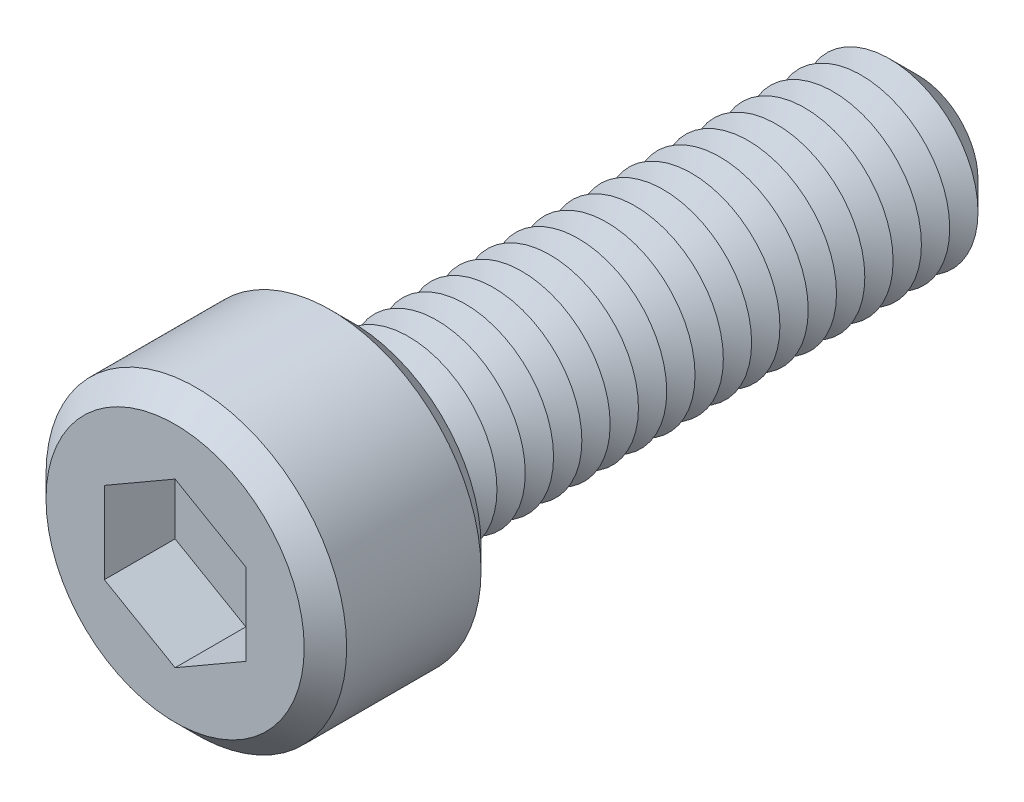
from build123d import *

# Parameters (mm, degrees)
SKETCH1_R           = 4.25
BOSS_EXTRUDE1_DEPTH = 5
SKETCH2_R           = 2.5
BOSS_EXTRUDE2_DEPTH = 16
CHAMFER1_SIZE       = 0.8
LPATTERN1_COUNT     = 19
LPATTERN1_PITCH     = 0.8
CUT_EXTRUDE1_DEPTH  = 2
SKETCH6_R           = 0.65
CUT_EXTRUDE2_DEPTH  = 19
CHAMFER2_SIZE       = 0.6


with BuildPart() as part:
    # Sketch1 → Boss-Extrude1 (new body)
    with BuildSketch(Plane.XY):
        Circle(SKETCH1_R)
    extrude(amount=BOSS_EXTRUDE1_DEPTH)

    # Sketch2 → Boss-Extrude2 (add)
    with BuildSketch(Plane(origin=(0, 0, 0), x_dir=(-1, 0, 0), z_dir=(0, 0, -1))):
        Circle(SKETCH2_R)
    extrude(amount=BOSS_EXTRUDE2_DEPTH)

    # Chamfer1
    chamfer1_edges = [part.edges().sort_by_distance(p)[0] for p in [
        (2.5, 0, -16),
    ]]
    chamfer(chamfer1_edges, length=CHAMFER1_SIZE)

    # Sketch4 → Cut-Revolve1 (revolve, cut)
    with BuildSketch(Plane(origin=(0, 0, 0), x_dir=(0, 0, -1), z_dir=(1, 0, 0)), mode=Mode.PRIVATE) as cut_revolve1_sk:
        Polygon((0, 2.5), (0.4, 1.807179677), (0.8, 2.5), align=None)
    cut_revolve1 = revolve(cut_revolve1_sk.sketch.rotate(Axis((0, 0, 2.512122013), (0, 0, -1)), 90), axis=Axis((0, 0, 2.512122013), (0, 0, -1)), mode=Mode.SUBTRACT)

    # LPattern1: Cut-Revolve1 ×19
    with Locations(*[(0, 0, -i * LPATTERN1_PITCH) for i in range(1, LPATTERN1_COUNT)]):
        add(cut_revolve1, mode=Mode.SUBTRACT)

    # Sketch5 → Cut-Extrude1 (cut)
    with BuildSketch(Plane.XY.offset(5)):
        Polygon((0, 2.309401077), (-2, 1.154700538), (-2, -1.154700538), (0, -2.309401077), (2, -1.154700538), (2, 1.154700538), align=None)
    extrude(amount=-CUT_EXTRUDE1_DEPTH, mode=Mode.SUBTRACT)

    # Sketch6 → Cut-Extrude2 (cut)
    with BuildSketch(Plane.XY.offset(3)):
        Circle(SKETCH6_R)
    extrude(amount=-CUT_EXTRUDE2_DEPTH, mode=Mode.SUBTRACT)

    # Chamfer2
    chamfer2_edges = [part.edges().sort_by_distance(p)[0] for p in [
        (-4.25, 0, 0),
        (-4.25, 0, 5),
    ]]
    chamfer(chamfer2_edges, length=CHAMFER2_SIZE)


solid = part.part
